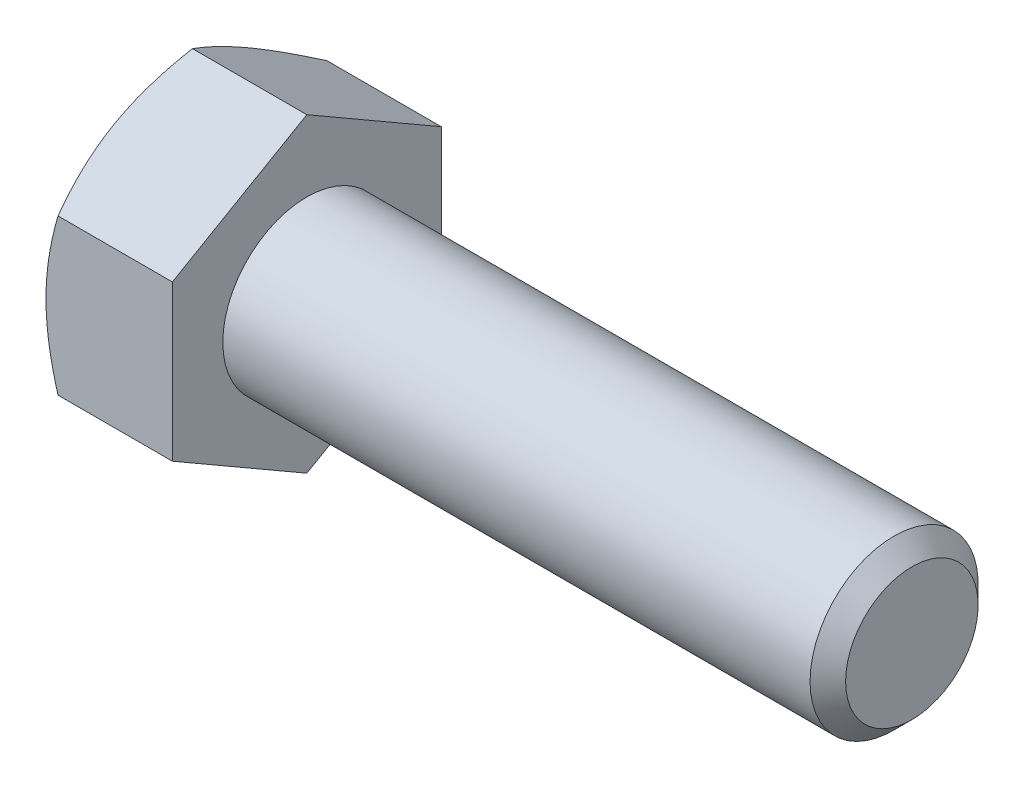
from build123d import *

# Parameters (mm, degrees)
BASEHEAD_DEPTH = 5.969


with BuildPart() as part:
    # Sketch1 → BaseHead (new body)
    with BuildSketch(Plane(origin=(0, 0, 0), x_dir=(0, 0, -1), z_dir=(1, 0, 0))):
        Polygon((6.35, 3.666174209), (6.35, -3.666174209), (0, -7.332348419), (-6.35, -3.666174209), (-6.35, 3.666174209), (0, 7.332348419), align=None)
    extrude(amount=BASEHEAD_DEPTH)

    # BodySke → BaseBody (revolve)
    with BuildSketch(Plane.XY, mode=Mode.PRIVATE) as basebody_sk:
        Polygon((0, 0), (34.544, 0), (34.544, 3.12928), (33.70453, 3.96875), (0, 3.96875), align=None)
    revolve(basebody_sk.sketch.rotate(Axis((0, 0, 0), (1, 0, 0)), 90), axis=Axis((0, 0, 0), (1, 0, 0)))

    # Sketch3 → HeadChamfer (revolve, cut)
    with BuildSketch(Plane.XY):
        Polygon((0, 6.35), (4.233333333, 13.682348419), (4.233333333, 20.032348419), (-12.7, 20.032348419), (-12.7, 6.35), align=None)
    revolve(axis=Axis((0, 0, 0), (1, 0, 0)), mode=Mode.SUBTRACT)


solid = part.part
